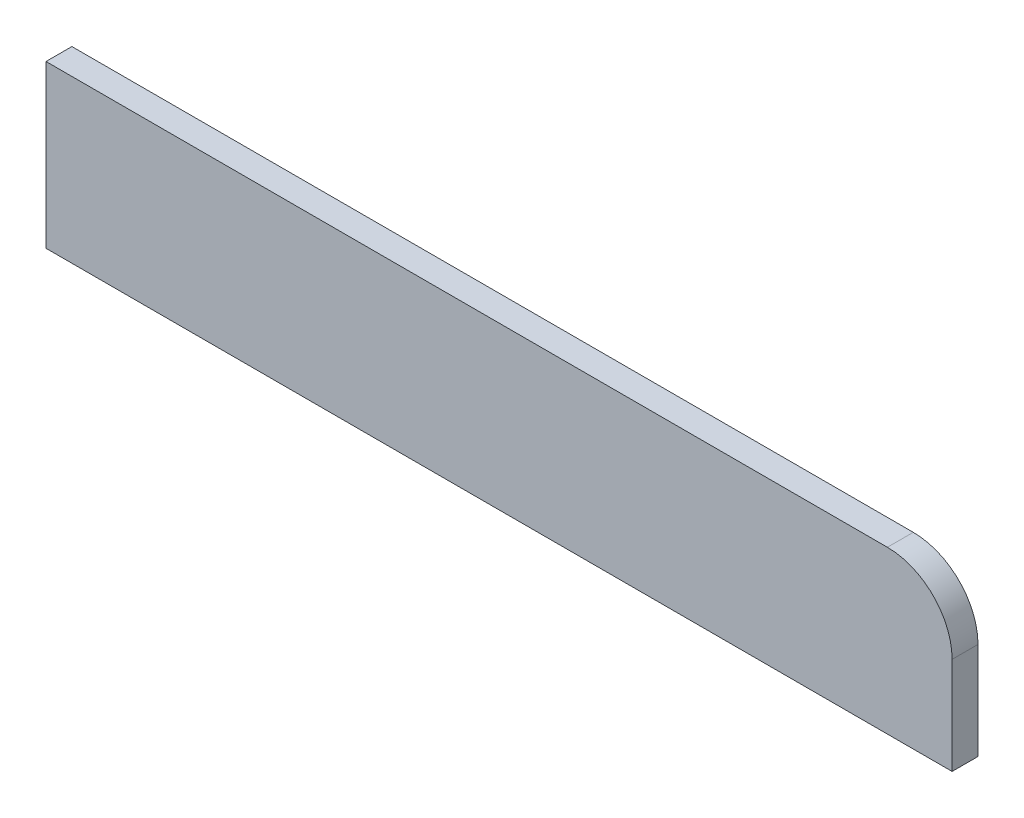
ISO-10303-21;
HEADER;
FILE_DESCRIPTION(('STEP AP214'),'2;1');
FILE_NAME('part.step','',(''),(''),'','','');
FILE_SCHEMA(('AUTOMOTIVE_DESIGN { 1 0 10303 214 1 1 1 1 }'));
ENDSEC;
DATA;
#1=APPLICATION_CONTEXT('core data for automotive mechanical design processes');
#2=APPLICATION_PROTOCOL_DEFINITION('international standard','automotive_design',2000,#1);
#3=PRODUCT_CONTEXT('',#1,'mechanical');
#4=PRODUCT('Part','Part','',(#3));
#5=PRODUCT_RELATED_PRODUCT_CATEGORY('part','',(#4));
#6=PRODUCT_DEFINITION_FORMATION('','',#4);
#7=PRODUCT_DEFINITION_CONTEXT('part definition',#1,'design');
#8=PRODUCT_DEFINITION('design','',#6,#7);
#9=PRODUCT_DEFINITION_SHAPE('','',#8);
#10=(LENGTH_UNIT() NAMED_UNIT(*) SI_UNIT(.MILLI.,.METRE.));
#11=(NAMED_UNIT(*) PLANE_ANGLE_UNIT() SI_UNIT($,.RADIAN.));
#12=(NAMED_UNIT(*) SI_UNIT($,.STERADIAN.) SOLID_ANGLE_UNIT());
#13=UNCERTAINTY_MEASURE_WITH_UNIT(LENGTH_MEASURE(1.E-05),#10,'distance_accuracy_value','');
#14=(GEOMETRIC_REPRESENTATION_CONTEXT(3) GLOBAL_UNCERTAINTY_ASSIGNED_CONTEXT((#13)) GLOBAL_UNIT_ASSIGNED_CONTEXT((#10,
#11,#12)) REPRESENTATION_CONTEXT('',''));
#15=CARTESIAN_POINT('',(0.,0.,0.));
#16=DIRECTION('',(0.,0.,1.));
#17=DIRECTION('',(1.,0.,0.));
#18=AXIS2_PLACEMENT_3D('',#15,#16,#17);
#19=CARTESIAN_POINT('',(0.,0.,8.));
#20=DIRECTION('',(0.,-1.,0.));
#21=DIRECTION('',(0.,0.,-1.));
#22=AXIS2_PLACEMENT_3D('',#19,#20,#21);
#23=PLANE('',#22);
#24=DIRECTION('',(-1.,0.,0.));
#25=VECTOR('',#24,1.);
#26=CARTESIAN_POINT('',(0.,0.,0.));
#27=LINE('',#26,#25);
#28=CARTESIAN_POINT('',(260.,0.,0.));
#29=VERTEX_POINT('',#28);
#30=CARTESIAN_POINT('',(0.,0.,0.));
#31=VERTEX_POINT('',#30);
#32=EDGE_CURVE('E79',#29,#31,#27,.T.);
#33=ORIENTED_EDGE('',*,*,#32,.T.);
#34=DIRECTION('',(0.,0.,-1.));
#35=VECTOR('',#34,1.);
#36=CARTESIAN_POINT('',(0.,0.,8.));
#37=LINE('',#36,#35);
#38=CARTESIAN_POINT('',(0.,0.,8.));
#39=VERTEX_POINT('',#38);
#40=EDGE_CURVE('E11',#39,#31,#37,.T.);
#41=ORIENTED_EDGE('',*,*,#40,.F.);
#42=DIRECTION('',(-1.,0.,0.));
#43=VECTOR('',#42,1.);
#44=CARTESIAN_POINT('',(0.,0.,8.));
#45=LINE('',#44,#43);
#46=CARTESIAN_POINT('',(260.,0.,8.));
#47=VERTEX_POINT('',#46);
#48=EDGE_CURVE('E100',#47,#39,#45,.T.);
#49=ORIENTED_EDGE('',*,*,#48,.F.);
#50=DIRECTION('',(0.,0.,-1.));
#51=VECTOR('',#50,1.);
#52=CARTESIAN_POINT('',(260.,0.,8.));
#53=LINE('',#52,#51);
#54=EDGE_CURVE('E92',#47,#29,#53,.T.);
#55=ORIENTED_EDGE('',*,*,#54,.T.);
#56=EDGE_LOOP('',(#33,#41,#49,#55));
#57=FACE_BOUND('',#56,.T.);
#58=ADVANCED_FACE('F29',(#57),#23,.F.);
#59=CARTESIAN_POINT('',(0.,0.,8.));
#60=DIRECTION('',(1.,0.,0.));
#61=DIRECTION('',(0.,1.,0.));
#62=AXIS2_PLACEMENT_3D('',#59,#60,#61);
#63=PLANE('',#62);
#64=DIRECTION('',(0.,-1.,0.));
#65=VECTOR('',#64,1.);
#66=CARTESIAN_POINT('',(0.,0.,0.));
#67=LINE('',#66,#65);
#68=CARTESIAN_POINT('',(0.,-50.,0.));
#69=VERTEX_POINT('',#68);
#70=EDGE_CURVE('E75',#31,#69,#67,.T.);
#71=ORIENTED_EDGE('',*,*,#70,.T.);
#72=DIRECTION('',(0.,0.,-1.));
#73=VECTOR('',#72,1.);
#74=CARTESIAN_POINT('',(0.,-50.,8.));
#75=LINE('',#74,#73);
#76=CARTESIAN_POINT('',(0.,-50.,8.));
#77=VERTEX_POINT('',#76);
#78=EDGE_CURVE('E36',#77,#69,#75,.T.);
#79=ORIENTED_EDGE('',*,*,#78,.F.);
#80=DIRECTION('',(0.,-1.,0.));
#81=VECTOR('',#80,1.);
#82=CARTESIAN_POINT('',(0.,0.,8.));
#83=LINE('',#82,#81);
#84=EDGE_CURVE('E88',#39,#77,#83,.T.);
#85=ORIENTED_EDGE('',*,*,#84,.F.);
#86=ORIENTED_EDGE('',*,*,#40,.T.);
#87=EDGE_LOOP('',(#71,#79,#85,#86));
#88=FACE_BOUND('',#87,.T.);
#89=ADVANCED_FACE('F87',(#88),#63,.F.);
#90=CARTESIAN_POINT('',(0.,-50.,8.));
#91=DIRECTION('',(0.,1.,0.));
#92=DIRECTION('',(0.,0.,1.));
#93=AXIS2_PLACEMENT_3D('',#90,#91,#92);
#94=PLANE('',#93);
#95=DIRECTION('',(1.,0.,0.));
#96=VECTOR('',#95,1.);
#97=CARTESIAN_POINT('',(0.,-50.,0.));
#98=LINE('',#97,#96);
#99=CARTESIAN_POINT('',(280.,-50.,0.));
#100=VERTEX_POINT('',#99);
#101=EDGE_CURVE('E81',#69,#100,#98,.T.);
#102=ORIENTED_EDGE('',*,*,#101,.T.);
#103=DIRECTION('',(0.,0.,-1.));
#104=VECTOR('',#103,1.);
#105=CARTESIAN_POINT('',(280.,-50.,8.));
#106=LINE('',#105,#104);
#107=CARTESIAN_POINT('',(280.,-50.,8.));
#108=VERTEX_POINT('',#107);
#109=EDGE_CURVE('E111',#108,#100,#106,.T.);
#110=ORIENTED_EDGE('',*,*,#109,.F.);
#111=DIRECTION('',(1.,0.,0.));
#112=VECTOR('',#111,1.);
#113=CARTESIAN_POINT('',(0.,-50.,8.));
#114=LINE('',#113,#112);
#115=EDGE_CURVE('E103',#77,#108,#114,.T.);
#116=ORIENTED_EDGE('',*,*,#115,.F.);
#117=ORIENTED_EDGE('',*,*,#78,.T.);
#118=EDGE_LOOP('',(#102,#110,#116,#117));
#119=FACE_BOUND('',#118,.T.);
#120=ADVANCED_FACE('F115',(#119),#94,.F.);
#121=CARTESIAN_POINT('',(280.,-50.,8.));
#122=DIRECTION('',(-1.,0.,0.));
#123=DIRECTION('',(0.,0.,1.));
#124=AXIS2_PLACEMENT_3D('',#121,#122,#123);
#125=PLANE('',#124);
#126=DIRECTION('',(0.,1.,0.));
#127=VECTOR('',#126,1.);
#128=CARTESIAN_POINT('',(280.,-50.,0.));
#129=LINE('',#128,#127);
#130=CARTESIAN_POINT('',(280.,-20.0000000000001,0.));
#131=VERTEX_POINT('',#130);
#132=EDGE_CURVE('E96',#100,#131,#129,.T.);
#133=ORIENTED_EDGE('',*,*,#132,.T.);
#134=DIRECTION('',(0.,0.,-1.));
#135=VECTOR('',#134,1.);
#136=CARTESIAN_POINT('',(280.,-20.0000000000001,8.));
#137=LINE('',#136,#135);
#138=CARTESIAN_POINT('',(280.,-20.0000000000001,8.));
#139=VERTEX_POINT('',#138);
#140=EDGE_CURVE('E108',#139,#131,#137,.T.);
#141=ORIENTED_EDGE('',*,*,#140,.F.);
#142=DIRECTION('',(0.,1.,0.));
#143=VECTOR('',#142,1.);
#144=CARTESIAN_POINT('',(280.,-50.,8.));
#145=LINE('',#144,#143);
#146=EDGE_CURVE('E48',#108,#139,#145,.T.);
#147=ORIENTED_EDGE('',*,*,#146,.F.);
#148=ORIENTED_EDGE('',*,*,#109,.T.);
#149=EDGE_LOOP('',(#133,#141,#147,#148));
#150=FACE_BOUND('',#149,.T.);
#151=ADVANCED_FACE('F126',(#150),#125,.F.);
#152=CARTESIAN_POINT('',(260.,-20.,8.));
#153=DIRECTION('',(0.,0.,-1.));
#154=DIRECTION('',(-1.,0.,0.));
#155=AXIS2_PLACEMENT_3D('',#152,#153,#154);
#156=CYLINDRICAL_SURFACE('',#155,20.);
#157=CARTESIAN_POINT('',(260.,-20.,0.));
#158=DIRECTION('',(0.,0.,1.));
#159=DIRECTION('',(1.,0.,0.));
#160=AXIS2_PLACEMENT_3D('',#157,#158,#159);
#161=CIRCLE('',#160,20.);
#162=EDGE_CURVE('E98',#131,#29,#161,.T.);
#163=ORIENTED_EDGE('',*,*,#162,.T.);
#164=ORIENTED_EDGE('',*,*,#54,.F.);
#165=CARTESIAN_POINT('',(260.,-20.,8.));
#166=DIRECTION('',(0.,0.,1.));
#167=DIRECTION('',(1.,0.,0.));
#168=AXIS2_PLACEMENT_3D('',#165,#166,#167);
#169=CIRCLE('',#168,20.);
#170=EDGE_CURVE('E43',#139,#47,#169,.T.);
#171=ORIENTED_EDGE('',*,*,#170,.F.);
#172=ORIENTED_EDGE('',*,*,#140,.T.);
#173=EDGE_LOOP('',(#163,#164,#171,#172));
#174=FACE_BOUND('',#173,.T.);
#175=ADVANCED_FACE('F119',(#174),#156,.T.);
#176=CARTESIAN_POINT('',(260.,-20.,8.));
#177=DIRECTION('',(0.,0.,1.));
#178=DIRECTION('',(1.,0.,0.));
#179=AXIS2_PLACEMENT_3D('',#176,#177,#178);
#180=PLANE('',#179);
#181=ORIENTED_EDGE('',*,*,#48,.T.);
#182=ORIENTED_EDGE('',*,*,#84,.T.);
#183=ORIENTED_EDGE('',*,*,#115,.T.);
#184=ORIENTED_EDGE('',*,*,#146,.T.);
#185=ORIENTED_EDGE('',*,*,#170,.T.);
#186=EDGE_LOOP('',(#181,#182,#183,#184,#185));
#187=FACE_BOUND('',#186,.T.);
#188=ADVANCED_FACE('F117',(#187),#180,.T.);
#189=CARTESIAN_POINT('',(260.,-20.,0.));
#190=DIRECTION('',(0.,0.,1.));
#191=DIRECTION('',(1.,0.,0.));
#192=AXIS2_PLACEMENT_3D('',#189,#190,#191);
#193=PLANE('',#192);
#194=ORIENTED_EDGE('',*,*,#32,.F.);
#195=ORIENTED_EDGE('',*,*,#162,.F.);
#196=ORIENTED_EDGE('',*,*,#132,.F.);
#197=ORIENTED_EDGE('',*,*,#101,.F.);
#198=ORIENTED_EDGE('',*,*,#70,.F.);
#199=EDGE_LOOP('',(#194,#195,#196,#197,#198));
#200=FACE_BOUND('',#199,.T.);
#201=ADVANCED_FACE('F76',(#200),#193,.F.);
#202=CLOSED_SHELL('',(#58,#89,#120,#151,#175,#188,#201));
#203=MANIFOLD_SOLID_BREP('B2',#202);
#204=ADVANCED_BREP_SHAPE_REPRESENTATION('',(#18,#203),#14);
#205=SHAPE_DEFINITION_REPRESENTATION(#9,#204);
ENDSEC;
END-ISO-10303-21;
